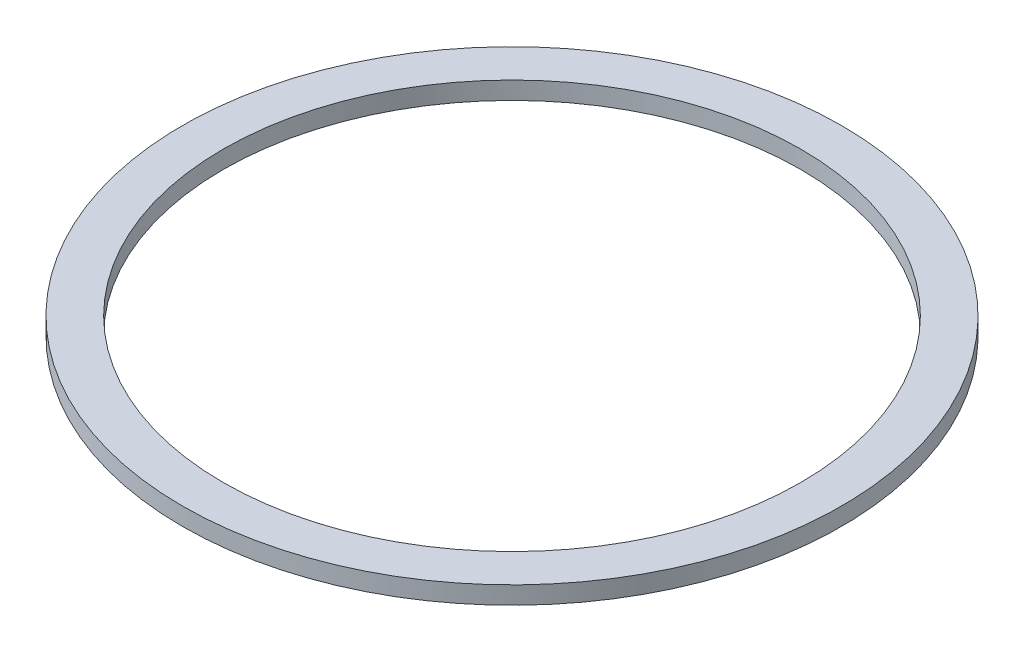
from build123d import *

# Parameters (mm, degrees)
SKETCH1_W = 10.9855
SKETCH1_H = 4.7625


with BuildPart() as part:
    # Sketch1 → Revolve1 (revolve)
    with BuildSketch(Plane.XY, mode=Mode.PRIVATE) as revolve1_sk:
        with Locations((83.28025, 2.38125)):
            Rectangle(SKETCH1_W, SKETCH1_H)
    revolve(revolve1_sk.sketch.rotate(Axis((0, 0, 0), (0, 1, 0)), 90), axis=Axis((0, 0, 0), (0, 1, 0)))


solid = part.part
